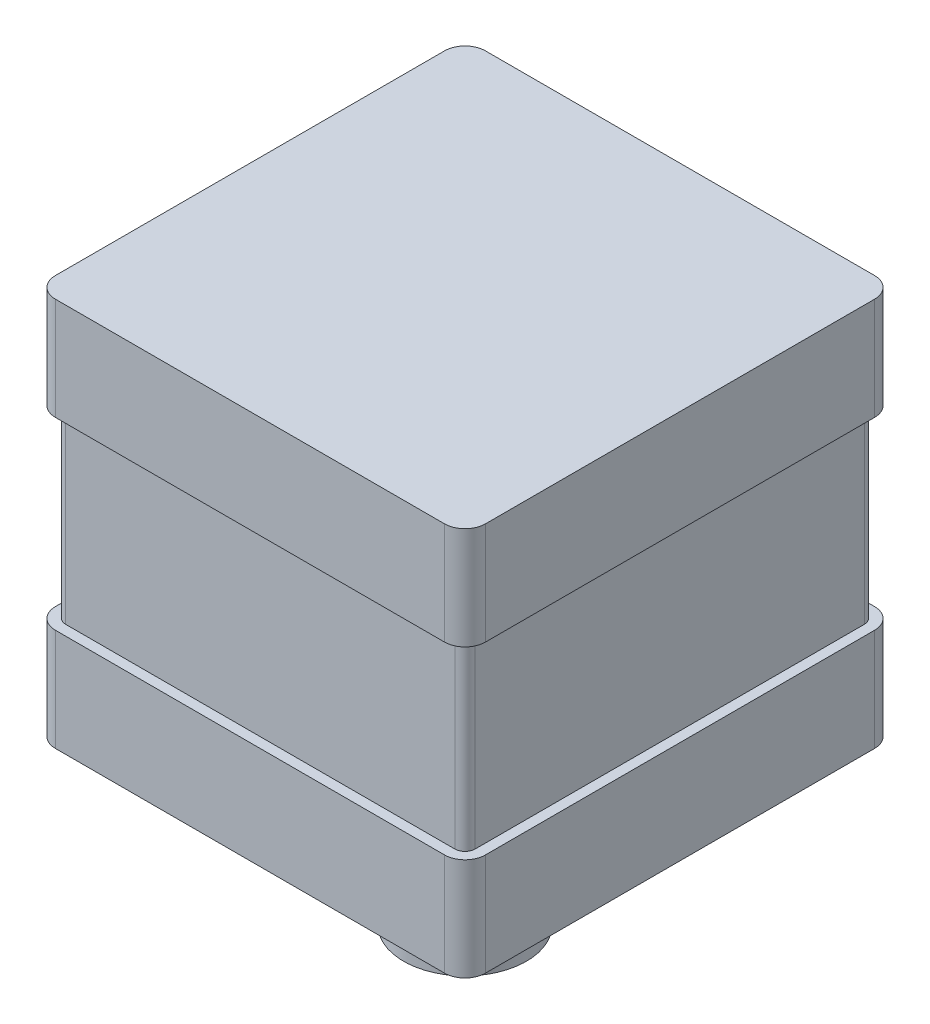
from build123d import *

# Parameters (mm, degrees)
EXTRUDE_1_DEPTH = 10
EXTRUDE_2_DEPTH = 18
EXTRUDE_START   = 10
EXTRUDE_3_DEPTH = 10
SKETCH_4_R      = 3
EXTRUDE_4_DEPTH = 15
SKETCH_5_R      = 6
EXTRUDE_6_DEPTH = 1
SKETCH_6_R      = 5
EXTRUDE_8_DEPTH = 4
EXTRUDE_START_2 = 1
SKETCH_7_R      = 6
EXTRUDE_9_DEPTH = 1


with BuildPart() as part:
    # Sketch 1 → Extrude 1 (new body)
    with BuildSketch(Plane(origin=(0, 0, 0), x_dir=(1, 0, 0), z_dir=(0, 1, 0))):
        with BuildLine():
            Line((-19, -21), (19, -21))
            ThreePointArc((19, -21), (20.414213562, -20.414213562), (21, -19))
            Line((21, -19), (21, 19))
            ThreePointArc((21, 19), (20.414213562, 20.414213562), (19, 21))
            Line((19, 21), (-19, 21))
            ThreePointArc((-19, 21), (-20.414213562, 20.414213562), (-21, 19))
            Line((-21, 19), (-21, -19))
            ThreePointArc((-21, -19), (-20.414213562, -20.414213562), (-19, -21))
        make_face()
    extrude(amount=EXTRUDE_1_DEPTH)

    # Sketch 2 → Extrude 2 (add)
    with BuildSketch(Plane.XZ):
        with BuildLine():
            Line((-19, -20), (19, -20))
            ThreePointArc((19, -20), (19.707106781, -19.707106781), (20, -19))
            Line((20, -19), (20, 19))
            ThreePointArc((20, 19), (19.707106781, 19.707106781), (19, 20))
            Line((19, 20), (-19, 20))
            ThreePointArc((-19, 20), (-19.707106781, 19.707106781), (-20, 19))
            Line((-20, 19), (-20, -19))
            ThreePointArc((-20, -19), (-19.707106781, -19.707106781), (-19, -20))
        make_face()
    extrude(amount=EXTRUDE_2_DEPTH)

    # Sketch 3 → Extrude 3 (add)
    with BuildSketch(Plane.XZ.offset(18).offset(EXTRUDE_START)):
        with BuildLine():
            Line((-19, -21), (19, -21))
            ThreePointArc((19, -21), (20.414213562, -20.414213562), (21, -19))
            Line((21, -19), (21, 19))
            ThreePointArc((21, 19), (20.414213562, 20.414213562), (19, 21))
            Line((19, 21), (-19, 21))
            ThreePointArc((-19, 21), (-20.414213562, 20.414213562), (-21, 19))
            Line((-21, 19), (-21, -19))
            ThreePointArc((-21, -19), (-20.414213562, -20.414213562), (-19, -21))
        make_face()
    extrude(amount=-EXTRUDE_3_DEPTH)

    # Sketch 4 → Extrude 4 (add)
    with BuildSketch(Plane.XZ.offset(28)):
        with Locations(Location((0, 0, 0), (0, 0, 270))):
            Circle(SKETCH_4_R)
    extrude(amount=EXTRUDE_4_DEPTH)

    # Sketch 5 → Extrude 6 (add)
    with BuildSketch(Plane.XZ.offset(43)):
        with Locations(Location((0, 0, 0), (0, 0, 270))):
            Circle(SKETCH_5_R)
    extrude(amount=EXTRUDE_6_DEPTH)

    # Sketch 6 → Extrude 8 (add)
    with BuildSketch(Plane(origin=(0, -43, 0), x_dir=(1, 0, 0), z_dir=(0, 1, 0))):
        with Locations(Location((0, 0, 0), (0, 0, 90))):
            Circle(SKETCH_6_R)
    extrude(amount=EXTRUDE_8_DEPTH)

    # Sketch 7 → Extrude 9 (add)
    with BuildSketch(Plane(origin=(0, -39, 0), x_dir=(1, 0, 0), z_dir=(0, 1, 0)).offset(EXTRUDE_START_2)):
        with Locations(Location((0, 0, 0), (0, 0, 270))):
            Circle(SKETCH_7_R)
    extrude(amount=-EXTRUDE_9_DEPTH)


solid = part.part
